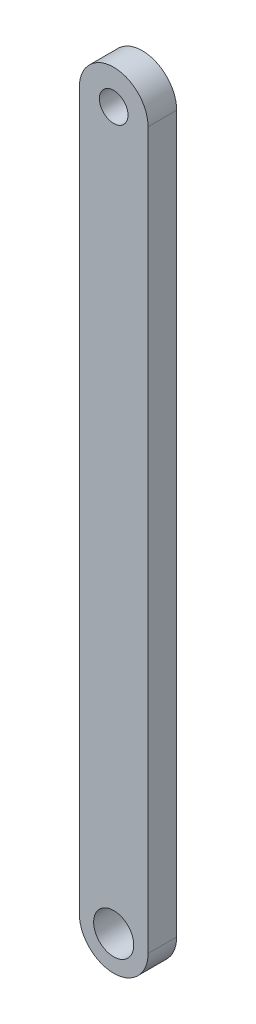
ISO-10303-21;
HEADER;
FILE_DESCRIPTION(('STEP AP214'),'2;1');
FILE_NAME('part.step','',(''),(''),'','','');
FILE_SCHEMA(('AUTOMOTIVE_DESIGN { 1 0 10303 214 1 1 1 1 }'));
ENDSEC;
DATA;
#1=APPLICATION_CONTEXT('core data for automotive mechanical design processes');
#2=APPLICATION_PROTOCOL_DEFINITION('international standard','automotive_design',2000,#1);
#3=PRODUCT_CONTEXT('',#1,'mechanical');
#4=PRODUCT('Part','Part','',(#3));
#5=PRODUCT_RELATED_PRODUCT_CATEGORY('part','',(#4));
#6=PRODUCT_DEFINITION_FORMATION('','',#4);
#7=PRODUCT_DEFINITION_CONTEXT('part definition',#1,'design');
#8=PRODUCT_DEFINITION('design','',#6,#7);
#9=PRODUCT_DEFINITION_SHAPE('','',#8);
#10=(LENGTH_UNIT() NAMED_UNIT(*) SI_UNIT(.MILLI.,.METRE.));
#11=(NAMED_UNIT(*) PLANE_ANGLE_UNIT() SI_UNIT($,.RADIAN.));
#12=(NAMED_UNIT(*) SI_UNIT($,.STERADIAN.) SOLID_ANGLE_UNIT());
#13=UNCERTAINTY_MEASURE_WITH_UNIT(LENGTH_MEASURE(1.E-05),#10,'distance_accuracy_value','');
#14=(GEOMETRIC_REPRESENTATION_CONTEXT(3) GLOBAL_UNCERTAINTY_ASSIGNED_CONTEXT((#13)) GLOBAL_UNIT_ASSIGNED_CONTEXT((#10,
#11,#12)) REPRESENTATION_CONTEXT('',''));
#15=CARTESIAN_POINT('',(0.,0.,0.));
#16=DIRECTION('',(0.,0.,1.));
#17=DIRECTION('',(1.,0.,0.));
#18=AXIS2_PLACEMENT_3D('',#15,#16,#17);
#19=CARTESIAN_POINT('',(0.,0.,10.));
#20=DIRECTION('',(0.,0.,-1.));
#21=DIRECTION('',(-1.,0.,0.));
#22=AXIS2_PLACEMENT_3D('',#19,#20,#21);
#23=PLANE('',#22);
#24=CARTESIAN_POINT('',(0.,0.,10.));
#25=DIRECTION('',(0.,0.,1.));
#26=DIRECTION('',(1.,0.,0.));
#27=AXIS2_PLACEMENT_3D('',#24,#25,#26);
#28=CIRCLE('',#27,5.);
#29=CARTESIAN_POINT('',(5.,0.,10.));
#30=VERTEX_POINT('',#29);
#31=EDGE_CURVE('E90',#30,#30,#28,.T.);
#32=ORIENTED_EDGE('',*,*,#31,.F.);
#33=EDGE_LOOP('',(#32));
#34=FACE_BOUND('',#33,.T.);
#35=CARTESIAN_POINT('',(0.,0.,10.));
#36=DIRECTION('',(0.,0.,1.));
#37=DIRECTION('',(-1.,0.,0.));
#38=AXIS2_PLACEMENT_3D('',#35,#36,#37);
#39=CIRCLE('',#38,12.);
#40=CARTESIAN_POINT('',(12.,0.,10.));
#41=VERTEX_POINT('',#40);
#42=CARTESIAN_POINT('',(-12.,0.,10.));
#43=VERTEX_POINT('',#42);
#44=EDGE_CURVE('E100',#41,#43,#39,.T.);
#45=ORIENTED_EDGE('',*,*,#44,.T.);
#46=DIRECTION('',(0.,-1.,0.));
#47=VECTOR('',#46,1.);
#48=CARTESIAN_POINT('',(-12.,0.,10.));
#49=LINE('',#48,#47);
#50=CARTESIAN_POINT('',(-12.,-250.,10.));
#51=VERTEX_POINT('',#50);
#52=EDGE_CURVE('E85',#43,#51,#49,.T.);
#53=ORIENTED_EDGE('',*,*,#52,.T.);
#54=CARTESIAN_POINT('',(0.,-250.,10.));
#55=DIRECTION('',(0.,0.,1.));
#56=DIRECTION('',(1.,0.,0.));
#57=AXIS2_PLACEMENT_3D('',#54,#55,#56);
#58=CIRCLE('',#57,12.);
#59=CARTESIAN_POINT('',(12.,-250.,10.));
#60=VERTEX_POINT('',#59);
#61=EDGE_CURVE('E51',#51,#60,#58,.T.);
#62=ORIENTED_EDGE('',*,*,#61,.T.);
#63=DIRECTION('',(0.,1.,0.));
#64=VECTOR('',#63,1.);
#65=CARTESIAN_POINT('',(12.,0.,10.));
#66=LINE('',#65,#64);
#67=EDGE_CURVE('E46',#60,#41,#66,.T.);
#68=ORIENTED_EDGE('',*,*,#67,.T.);
#69=EDGE_LOOP('',(#45,#53,#62,#68));
#70=FACE_BOUND('',#69,.T.);
#71=CARTESIAN_POINT('',(0.,-250.,10.));
#72=DIRECTION('',(0.,0.,1.));
#73=DIRECTION('',(1.,0.,0.));
#74=AXIS2_PLACEMENT_3D('',#71,#72,#73);
#75=CIRCLE('',#74,7.);
#76=CARTESIAN_POINT('',(7.00000000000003,-250.,10.));
#77=VERTEX_POINT('',#76);
#78=EDGE_CURVE('E118',#77,#77,#75,.T.);
#79=ORIENTED_EDGE('',*,*,#78,.F.);
#80=EDGE_LOOP('',(#79));
#81=FACE_BOUND('',#80,.T.);
#82=ADVANCED_FACE('F31',(#34,#70,#81),#23,.F.);
#83=CARTESIAN_POINT('',(0.,0.,0.));
#84=DIRECTION('',(0.,0.,-1.));
#85=DIRECTION('',(-1.,0.,0.));
#86=AXIS2_PLACEMENT_3D('',#83,#84,#85);
#87=PLANE('',#86);
#88=CARTESIAN_POINT('',(0.,0.,0.));
#89=DIRECTION('',(0.,0.,1.));
#90=DIRECTION('',(1.,0.,0.));
#91=AXIS2_PLACEMENT_3D('',#88,#89,#90);
#92=CIRCLE('',#91,5.);
#93=CARTESIAN_POINT('',(5.,0.,0.));
#94=VERTEX_POINT('',#93);
#95=EDGE_CURVE('E93',#94,#94,#92,.T.);
#96=ORIENTED_EDGE('',*,*,#95,.T.);
#97=EDGE_LOOP('',(#96));
#98=FACE_BOUND('',#97,.T.);
#99=CARTESIAN_POINT('',(0.,0.,0.));
#100=DIRECTION('',(0.,0.,1.));
#101=DIRECTION('',(-1.,0.,0.));
#102=AXIS2_PLACEMENT_3D('',#99,#100,#101);
#103=CIRCLE('',#102,12.);
#104=CARTESIAN_POINT('',(12.,0.,0.));
#105=VERTEX_POINT('',#104);
#106=CARTESIAN_POINT('',(-12.,0.,0.));
#107=VERTEX_POINT('',#106);
#108=EDGE_CURVE('E77',#105,#107,#103,.T.);
#109=ORIENTED_EDGE('',*,*,#108,.F.);
#110=DIRECTION('',(0.,1.,0.));
#111=VECTOR('',#110,1.);
#112=CARTESIAN_POINT('',(12.,0.,0.));
#113=LINE('',#112,#111);
#114=CARTESIAN_POINT('',(12.,-250.,0.));
#115=VERTEX_POINT('',#114);
#116=EDGE_CURVE('E98',#115,#105,#113,.T.);
#117=ORIENTED_EDGE('',*,*,#116,.F.);
#118=CARTESIAN_POINT('',(0.,-250.,0.));
#119=DIRECTION('',(0.,0.,1.));
#120=DIRECTION('',(1.,0.,0.));
#121=AXIS2_PLACEMENT_3D('',#118,#119,#120);
#122=CIRCLE('',#121,12.);
#123=CARTESIAN_POINT('',(-12.,-250.,0.));
#124=VERTEX_POINT('',#123);
#125=EDGE_CURVE('E78',#124,#115,#122,.T.);
#126=ORIENTED_EDGE('',*,*,#125,.F.);
#127=DIRECTION('',(0.,-1.,0.));
#128=VECTOR('',#127,1.);
#129=CARTESIAN_POINT('',(-12.,0.,0.));
#130=LINE('',#129,#128);
#131=EDGE_CURVE('E72',#107,#124,#130,.T.);
#132=ORIENTED_EDGE('',*,*,#131,.F.);
#133=EDGE_LOOP('',(#109,#117,#126,#132));
#134=FACE_BOUND('',#133,.T.);
#135=CARTESIAN_POINT('',(0.,-250.,0.));
#136=DIRECTION('',(0.,0.,1.));
#137=DIRECTION('',(1.,0.,0.));
#138=AXIS2_PLACEMENT_3D('',#135,#136,#137);
#139=CIRCLE('',#138,7.);
#140=CARTESIAN_POINT('',(7.00000000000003,-250.,0.));
#141=VERTEX_POINT('',#140);
#142=EDGE_CURVE('E120',#141,#141,#139,.T.);
#143=ORIENTED_EDGE('',*,*,#142,.T.);
#144=EDGE_LOOP('',(#143));
#145=FACE_BOUND('',#144,.T.);
#146=ADVANCED_FACE('F73',(#98,#134,#145),#87,.T.);
#147=CARTESIAN_POINT('',(0.,0.,10.));
#148=DIRECTION('',(0.,0.,-1.));
#149=DIRECTION('',(-1.,0.,0.));
#150=AXIS2_PLACEMENT_3D('',#147,#148,#149);
#151=CYLINDRICAL_SURFACE('',#150,12.);
#152=ORIENTED_EDGE('',*,*,#108,.T.);
#153=DIRECTION('',(0.,0.,-1.));
#154=VECTOR('',#153,1.);
#155=CARTESIAN_POINT('',(-12.,0.,10.));
#156=LINE('',#155,#154);
#157=EDGE_CURVE('E11',#43,#107,#156,.T.);
#158=ORIENTED_EDGE('',*,*,#157,.F.);
#159=ORIENTED_EDGE('',*,*,#44,.F.);
#160=DIRECTION('',(0.,0.,-1.));
#161=VECTOR('',#160,1.);
#162=CARTESIAN_POINT('',(12.,0.,10.));
#163=LINE('',#162,#161);
#164=EDGE_CURVE('E89',#41,#105,#163,.T.);
#165=ORIENTED_EDGE('',*,*,#164,.T.);
#166=EDGE_LOOP('',(#152,#158,#159,#165));
#167=FACE_BOUND('',#166,.T.);
#168=ADVANCED_FACE('F33',(#167),#151,.T.);
#169=CARTESIAN_POINT('',(-12.,0.,10.));
#170=DIRECTION('',(1.,0.,0.));
#171=DIRECTION('',(0.,1.,0.));
#172=AXIS2_PLACEMENT_3D('',#169,#170,#171);
#173=PLANE('',#172);
#174=ORIENTED_EDGE('',*,*,#131,.T.);
#175=DIRECTION('',(0.,0.,-1.));
#176=VECTOR('',#175,1.);
#177=CARTESIAN_POINT('',(-12.,-250.,10.));
#178=LINE('',#177,#176);
#179=EDGE_CURVE('E39',#51,#124,#178,.T.);
#180=ORIENTED_EDGE('',*,*,#179,.F.);
#181=ORIENTED_EDGE('',*,*,#52,.F.);
#182=ORIENTED_EDGE('',*,*,#157,.T.);
#183=EDGE_LOOP('',(#174,#180,#181,#182));
#184=FACE_BOUND('',#183,.T.);
#185=ADVANCED_FACE('F84',(#184),#173,.F.);
#186=CARTESIAN_POINT('',(0.,-250.,10.));
#187=DIRECTION('',(0.,0.,-1.));
#188=DIRECTION('',(-1.,0.,0.));
#189=AXIS2_PLACEMENT_3D('',#186,#187,#188);
#190=CYLINDRICAL_SURFACE('',#189,12.);
#191=ORIENTED_EDGE('',*,*,#125,.T.);
#192=DIRECTION('',(0.,0.,-1.));
#193=VECTOR('',#192,1.);
#194=CARTESIAN_POINT('',(12.,-250.,10.));
#195=LINE('',#194,#193);
#196=EDGE_CURVE('E106',#60,#115,#195,.T.);
#197=ORIENTED_EDGE('',*,*,#196,.F.);
#198=ORIENTED_EDGE('',*,*,#61,.F.);
#199=ORIENTED_EDGE('',*,*,#179,.T.);
#200=EDGE_LOOP('',(#191,#197,#198,#199));
#201=FACE_BOUND('',#200,.T.);
#202=ADVANCED_FACE('F109',(#201),#190,.T.);
#203=CARTESIAN_POINT('',(12.,0.,10.));
#204=DIRECTION('',(-1.,0.,0.));
#205=DIRECTION('',(0.,-1.,0.));
#206=AXIS2_PLACEMENT_3D('',#203,#204,#205);
#207=PLANE('',#206);
#208=ORIENTED_EDGE('',*,*,#116,.T.);
#209=ORIENTED_EDGE('',*,*,#164,.F.);
#210=ORIENTED_EDGE('',*,*,#67,.F.);
#211=ORIENTED_EDGE('',*,*,#196,.T.);
#212=EDGE_LOOP('',(#208,#209,#210,#211));
#213=FACE_BOUND('',#212,.T.);
#214=ADVANCED_FACE('F111',(#213),#207,.F.);
#215=CARTESIAN_POINT('',(0.,0.,10.));
#216=DIRECTION('',(0.,0.,-1.));
#217=DIRECTION('',(-1.,0.,0.));
#218=AXIS2_PLACEMENT_3D('',#215,#216,#217);
#219=CYLINDRICAL_SURFACE('',#218,5.);
#220=ORIENTED_EDGE('',*,*,#31,.T.);
#221=EDGE_LOOP('',(#220));
#222=FACE_BOUND('',#221,.T.);
#223=ORIENTED_EDGE('',*,*,#95,.F.);
#224=EDGE_LOOP('',(#223));
#225=FACE_BOUND('',#224,.T.);
#226=ADVANCED_FACE('F129',(#222,#225),#219,.F.);
#227=CARTESIAN_POINT('',(0.,-250.,10.));
#228=DIRECTION('',(0.,0.,-1.));
#229=DIRECTION('',(-1.,0.,0.));
#230=AXIS2_PLACEMENT_3D('',#227,#228,#229);
#231=CYLINDRICAL_SURFACE('',#230,7.);
#232=ORIENTED_EDGE('',*,*,#78,.T.);
#233=EDGE_LOOP('',(#232));
#234=FACE_BOUND('',#233,.T.);
#235=ORIENTED_EDGE('',*,*,#142,.F.);
#236=EDGE_LOOP('',(#235));
#237=FACE_BOUND('',#236,.T.);
#238=ADVANCED_FACE('F127',(#234,#237),#231,.F.);
#239=CLOSED_SHELL('',(#82,#146,#168,#185,#202,#214,#226,#238));
#240=MANIFOLD_SOLID_BREP('B2',#239);
#241=ADVANCED_BREP_SHAPE_REPRESENTATION('',(#18,#240),#14);
#242=SHAPE_DEFINITION_REPRESENTATION(#9,#241);
ENDSEC;
END-ISO-10303-21;
